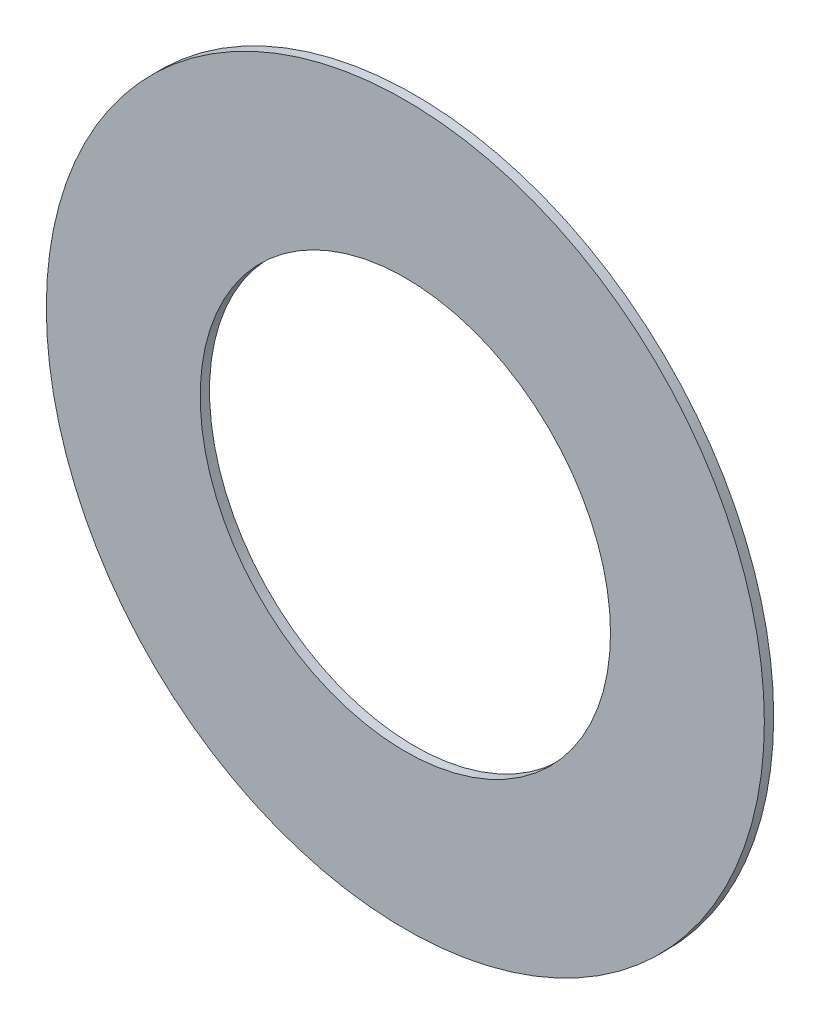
from build123d import *

# Parameters (mm, degrees)
ESQUISSE1_R      = 192.5
ESQUISSE1_R_2    = 110
EXTRUSION1_DEPTH = 5


with BuildPart() as part:
    # Esquisse1 → Extrusion1 (new body)
    with BuildSketch(Plane.XY):
        Circle(ESQUISSE1_R)
        Circle(ESQUISSE1_R_2, mode=Mode.SUBTRACT)
    extrude(amount=EXTRUSION1_DEPTH)


solid = part.part
